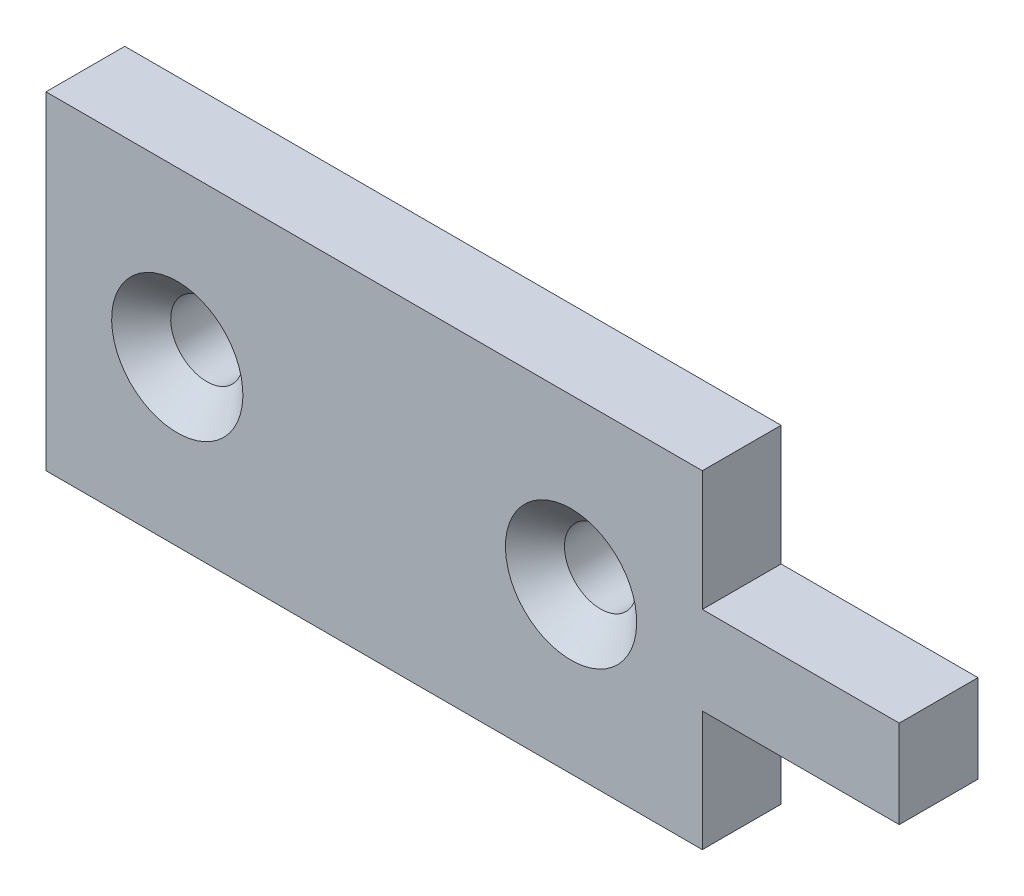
ISO-10303-21;
HEADER;
FILE_DESCRIPTION(('STEP AP214'),'2;1');
FILE_NAME('part.step','',(''),(''),'','','');
FILE_SCHEMA(('AUTOMOTIVE_DESIGN { 1 0 10303 214 1 1 1 1 }'));
ENDSEC;
DATA;
#1=APPLICATION_CONTEXT('core data for automotive mechanical design processes');
#2=APPLICATION_PROTOCOL_DEFINITION('international standard','automotive_design',2000,#1);
#3=PRODUCT_CONTEXT('',#1,'mechanical');
#4=PRODUCT('Part','Part','',(#3));
#5=PRODUCT_RELATED_PRODUCT_CATEGORY('part','',(#4));
#6=PRODUCT_DEFINITION_FORMATION('','',#4);
#7=PRODUCT_DEFINITION_CONTEXT('part definition',#1,'design');
#8=PRODUCT_DEFINITION('design','',#6,#7);
#9=PRODUCT_DEFINITION_SHAPE('','',#8);
#10=(LENGTH_UNIT() NAMED_UNIT(*) SI_UNIT(.MILLI.,.METRE.));
#11=(NAMED_UNIT(*) PLANE_ANGLE_UNIT() SI_UNIT($,.RADIAN.));
#12=(NAMED_UNIT(*) SI_UNIT($,.STERADIAN.) SOLID_ANGLE_UNIT());
#13=UNCERTAINTY_MEASURE_WITH_UNIT(LENGTH_MEASURE(1.E-05),#10,'distance_accuracy_value','');
#14=(GEOMETRIC_REPRESENTATION_CONTEXT(3) GLOBAL_UNCERTAINTY_ASSIGNED_CONTEXT((#13)) GLOBAL_UNIT_ASSIGNED_CONTEXT((#10,
#11,#12)) REPRESENTATION_CONTEXT('',''));
#15=CARTESIAN_POINT('',(0.,0.,0.));
#16=DIRECTION('',(0.,0.,1.));
#17=DIRECTION('',(1.,0.,0.));
#18=AXIS2_PLACEMENT_3D('',#15,#16,#17);
#19=CARTESIAN_POINT('',(55.,3.35,6.));
#20=DIRECTION('',(0.,0.,1.));
#21=DIRECTION('',(0.,1.,0.));
#22=AXIS2_PLACEMENT_3D('',#19,#20,#21);
#23=PLANE('',#22);
#24=CARTESIAN_POINT('',(30.,0.,6.));
#25=DIRECTION('',(0.,0.,1.));
#26=DIRECTION('',(0.,1.,0.));
#27=AXIS2_PLACEMENT_3D('',#24,#25,#26);
#28=CIRCLE('',#27,5.);
#29=CARTESIAN_POINT('',(30.,5.,6.));
#30=VERTEX_POINT('',#29);
#31=EDGE_CURVE('E22',#30,#30,#28,.F.);
#32=ORIENTED_EDGE('',*,*,#31,.T.);
#33=EDGE_LOOP('',(#32));
#34=FACE_BOUND('',#33,.T.);
#35=CARTESIAN_POINT('',(0.,0.,6.));
#36=DIRECTION('',(0.,0.,1.));
#37=DIRECTION('',(0.,1.,0.));
#38=AXIS2_PLACEMENT_3D('',#35,#36,#37);
#39=CIRCLE('',#38,5.);
#40=CARTESIAN_POINT('',(0.,5.,6.));
#41=VERTEX_POINT('',#40);
#42=EDGE_CURVE('E153',#41,#41,#39,.F.);
#43=ORIENTED_EDGE('',*,*,#42,.T.);
#44=EDGE_LOOP('',(#43));
#45=FACE_BOUND('',#44,.T.);
#46=DIRECTION('',(0.,1.,0.));
#47=VECTOR('',#46,1.);
#48=CARTESIAN_POINT('',(55.,-3.35,6.));
#49=LINE('',#48,#47);
#50=CARTESIAN_POINT('',(55.,-3.35,6.));
#51=VERTEX_POINT('',#50);
#52=CARTESIAN_POINT('',(55.,3.35,6.));
#53=VERTEX_POINT('',#52);
#54=EDGE_CURVE('E121',#51,#53,#49,.T.);
#55=ORIENTED_EDGE('',*,*,#54,.T.);
#56=DIRECTION('',(-1.,0.,0.));
#57=VECTOR('',#56,1.);
#58=CARTESIAN_POINT('',(55.,3.35,6.));
#59=LINE('',#58,#57);
#60=CARTESIAN_POINT('',(40.,3.35,6.));
#61=VERTEX_POINT('',#60);
#62=EDGE_CURVE('E95',#53,#61,#59,.T.);
#63=ORIENTED_EDGE('',*,*,#62,.T.);
#64=DIRECTION('',(0.,1.,0.));
#65=VECTOR('',#64,1.);
#66=CARTESIAN_POINT('',(40.,3.35,6.));
#67=LINE('',#66,#65);
#68=CARTESIAN_POINT('',(40.,12.5,6.));
#69=VERTEX_POINT('',#68);
#70=EDGE_CURVE('E124',#61,#69,#67,.T.);
#71=ORIENTED_EDGE('',*,*,#70,.T.);
#72=DIRECTION('',(-1.,0.,0.));
#73=VECTOR('',#72,1.);
#74=CARTESIAN_POINT('',(40.,12.5,6.));
#75=LINE('',#74,#73);
#76=CARTESIAN_POINT('',(-10.,12.5,6.));
#77=VERTEX_POINT('',#76);
#78=EDGE_CURVE('E126',#69,#77,#75,.T.);
#79=ORIENTED_EDGE('',*,*,#78,.T.);
#80=DIRECTION('',(0.,-1.,0.));
#81=VECTOR('',#80,1.);
#82=CARTESIAN_POINT('',(-10.,-12.5,6.));
#83=LINE('',#82,#81);
#84=CARTESIAN_POINT('',(-10.,-12.5,6.));
#85=VERTEX_POINT('',#84);
#86=EDGE_CURVE('E128',#77,#85,#83,.T.);
#87=ORIENTED_EDGE('',*,*,#86,.T.);
#88=DIRECTION('',(1.,0.,0.));
#89=VECTOR('',#88,1.);
#90=CARTESIAN_POINT('',(40.,-12.5,6.));
#91=LINE('',#90,#89);
#92=CARTESIAN_POINT('',(40.,-12.5,6.));
#93=VERTEX_POINT('',#92);
#94=EDGE_CURVE('E130',#85,#93,#91,.T.);
#95=ORIENTED_EDGE('',*,*,#94,.T.);
#96=DIRECTION('',(0.,1.,0.));
#97=VECTOR('',#96,1.);
#98=CARTESIAN_POINT('',(40.,-3.35,6.));
#99=LINE('',#98,#97);
#100=CARTESIAN_POINT('',(40.,-3.35,6.));
#101=VERTEX_POINT('',#100);
#102=EDGE_CURVE('E34',#93,#101,#99,.T.);
#103=ORIENTED_EDGE('',*,*,#102,.T.);
#104=DIRECTION('',(1.,0.,0.));
#105=VECTOR('',#104,1.);
#106=CARTESIAN_POINT('',(55.,-3.35,6.));
#107=LINE('',#106,#105);
#108=EDGE_CURVE('E29',#101,#51,#107,.T.);
#109=ORIENTED_EDGE('',*,*,#108,.T.);
#110=EDGE_LOOP('',(#55,#63,#71,#79,#87,#95,#103,#109));
#111=FACE_BOUND('',#110,.T.);
#112=ADVANCED_FACE('F14',(#34,#45,#111),#23,.T.);
#113=CARTESIAN_POINT('',(55.,3.35,0.));
#114=DIRECTION('',(0.,0.,1.));
#115=DIRECTION('',(0.,1.,0.));
#116=AXIS2_PLACEMENT_3D('',#113,#114,#115);
#117=PLANE('',#116);
#118=CARTESIAN_POINT('',(30.,0.,0.));
#119=DIRECTION('',(0.,0.,1.));
#120=DIRECTION('',(0.,1.,0.));
#121=AXIS2_PLACEMENT_3D('',#118,#119,#120);
#122=CIRCLE('',#121,2.75);
#123=CARTESIAN_POINT('',(30.,2.75,0.));
#124=VERTEX_POINT('',#123);
#125=EDGE_CURVE('E103',#124,#124,#122,.T.);
#126=ORIENTED_EDGE('',*,*,#125,.T.);
#127=EDGE_LOOP('',(#126));
#128=FACE_BOUND('',#127,.T.);
#129=DIRECTION('',(0.,1.,0.));
#130=VECTOR('',#129,1.);
#131=CARTESIAN_POINT('',(55.,-3.35,0.));
#132=LINE('',#131,#130);
#133=CARTESIAN_POINT('',(55.,-3.35,0.));
#134=VERTEX_POINT('',#133);
#135=CARTESIAN_POINT('',(55.,3.35,0.));
#136=VERTEX_POINT('',#135);
#137=EDGE_CURVE('E85',#134,#136,#132,.T.);
#138=ORIENTED_EDGE('',*,*,#137,.F.);
#139=DIRECTION('',(1.,0.,0.));
#140=VECTOR('',#139,1.);
#141=CARTESIAN_POINT('',(55.,-3.35,0.));
#142=LINE('',#141,#140);
#143=CARTESIAN_POINT('',(40.,-3.35,0.));
#144=VERTEX_POINT('',#143);
#145=EDGE_CURVE('E119',#144,#134,#142,.T.);
#146=ORIENTED_EDGE('',*,*,#145,.F.);
#147=DIRECTION('',(0.,1.,0.));
#148=VECTOR('',#147,1.);
#149=CARTESIAN_POINT('',(40.,-3.35,0.));
#150=LINE('',#149,#148);
#151=CARTESIAN_POINT('',(40.,-12.5,0.));
#152=VERTEX_POINT('',#151);
#153=EDGE_CURVE('E117',#152,#144,#150,.T.);
#154=ORIENTED_EDGE('',*,*,#153,.F.);
#155=DIRECTION('',(1.,0.,0.));
#156=VECTOR('',#155,1.);
#157=CARTESIAN_POINT('',(40.,-12.5,0.));
#158=LINE('',#157,#156);
#159=CARTESIAN_POINT('',(-10.,-12.5,0.));
#160=VERTEX_POINT('',#159);
#161=EDGE_CURVE('E115',#160,#152,#158,.T.);
#162=ORIENTED_EDGE('',*,*,#161,.F.);
#163=DIRECTION('',(0.,-1.,0.));
#164=VECTOR('',#163,1.);
#165=CARTESIAN_POINT('',(-10.,-12.5,0.));
#166=LINE('',#165,#164);
#167=CARTESIAN_POINT('',(-10.,12.5,0.));
#168=VERTEX_POINT('',#167);
#169=EDGE_CURVE('E113',#168,#160,#166,.T.);
#170=ORIENTED_EDGE('',*,*,#169,.F.);
#171=DIRECTION('',(-1.,0.,0.));
#172=VECTOR('',#171,1.);
#173=CARTESIAN_POINT('',(40.,12.5,0.));
#174=LINE('',#173,#172);
#175=CARTESIAN_POINT('',(40.,12.5,0.));
#176=VERTEX_POINT('',#175);
#177=EDGE_CURVE('E111',#176,#168,#174,.T.);
#178=ORIENTED_EDGE('',*,*,#177,.F.);
#179=DIRECTION('',(0.,1.,0.));
#180=VECTOR('',#179,1.);
#181=CARTESIAN_POINT('',(40.,3.35,0.));
#182=LINE('',#181,#180);
#183=CARTESIAN_POINT('',(40.,3.35,0.));
#184=VERTEX_POINT('',#183);
#185=EDGE_CURVE('E87',#184,#176,#182,.T.);
#186=ORIENTED_EDGE('',*,*,#185,.F.);
#187=DIRECTION('',(-1.,0.,0.));
#188=VECTOR('',#187,1.);
#189=CARTESIAN_POINT('',(55.,3.35,0.));
#190=LINE('',#189,#188);
#191=EDGE_CURVE('E79',#136,#184,#190,.T.);
#192=ORIENTED_EDGE('',*,*,#191,.F.);
#193=EDGE_LOOP('',(#138,#146,#154,#162,#170,#178,#186,#192));
#194=FACE_BOUND('',#193,.T.);
#195=CARTESIAN_POINT('',(0.,0.,0.));
#196=DIRECTION('',(0.,0.,1.));
#197=DIRECTION('',(0.,1.,0.));
#198=AXIS2_PLACEMENT_3D('',#195,#196,#197);
#199=CIRCLE('',#198,2.75);
#200=CARTESIAN_POINT('',(0.,2.75,0.));
#201=VERTEX_POINT('',#200);
#202=EDGE_CURVE('E106',#201,#201,#199,.T.);
#203=ORIENTED_EDGE('',*,*,#202,.T.);
#204=EDGE_LOOP('',(#203));
#205=FACE_BOUND('',#204,.T.);
#206=ADVANCED_FACE('F81',(#128,#194,#205),#117,.F.);
#207=CARTESIAN_POINT('',(55.,-3.35,6.));
#208=DIRECTION('',(-1.,0.,0.));
#209=DIRECTION('',(0.,-1.,0.));
#210=AXIS2_PLACEMENT_3D('',#207,#208,#209);
#211=PLANE('',#210);
#212=ORIENTED_EDGE('',*,*,#137,.T.);
#213=DIRECTION('',(0.,0.,-1.));
#214=VECTOR('',#213,1.);
#215=CARTESIAN_POINT('',(55.,3.35,6.));
#216=LINE('',#215,#214);
#217=EDGE_CURVE('E93',#53,#136,#216,.T.);
#218=ORIENTED_EDGE('',*,*,#217,.F.);
#219=ORIENTED_EDGE('',*,*,#54,.F.);
#220=DIRECTION('',(0.,0.,-1.));
#221=VECTOR('',#220,1.);
#222=CARTESIAN_POINT('',(55.,-3.35,6.));
#223=LINE('',#222,#221);
#224=EDGE_CURVE('E102',#51,#134,#223,.T.);
#225=ORIENTED_EDGE('',*,*,#224,.T.);
#226=EDGE_LOOP('',(#212,#218,#219,#225));
#227=FACE_BOUND('',#226,.T.);
#228=ADVANCED_FACE('F16',(#227),#211,.F.);
#229=CARTESIAN_POINT('',(55.,3.35,6.));
#230=DIRECTION('',(0.,-1.,0.));
#231=DIRECTION('',(1.,0.,0.));
#232=AXIS2_PLACEMENT_3D('',#229,#230,#231);
#233=PLANE('',#232);
#234=ORIENTED_EDGE('',*,*,#191,.T.);
#235=DIRECTION('',(0.,0.,-1.));
#236=VECTOR('',#235,1.);
#237=CARTESIAN_POINT('',(40.,3.35,6.));
#238=LINE('',#237,#236);
#239=EDGE_CURVE('E99',#61,#184,#238,.T.);
#240=ORIENTED_EDGE('',*,*,#239,.F.);
#241=ORIENTED_EDGE('',*,*,#62,.F.);
#242=ORIENTED_EDGE('',*,*,#217,.T.);
#243=EDGE_LOOP('',(#234,#240,#241,#242));
#244=FACE_BOUND('',#243,.T.);
#245=ADVANCED_FACE('F94',(#244),#233,.F.);
#246=CARTESIAN_POINT('',(40.,3.35,6.));
#247=DIRECTION('',(-1.,0.,0.));
#248=DIRECTION('',(0.,-1.,0.));
#249=AXIS2_PLACEMENT_3D('',#246,#247,#248);
#250=PLANE('',#249);
#251=ORIENTED_EDGE('',*,*,#185,.T.);
#252=DIRECTION('',(0.,0.,-1.));
#253=VECTOR('',#252,1.);
#254=CARTESIAN_POINT('',(40.,12.5,6.));
#255=LINE('',#254,#253);
#256=EDGE_CURVE('E147',#69,#176,#255,.T.);
#257=ORIENTED_EDGE('',*,*,#256,.F.);
#258=ORIENTED_EDGE('',*,*,#70,.F.);
#259=ORIENTED_EDGE('',*,*,#239,.T.);
#260=EDGE_LOOP('',(#251,#257,#258,#259));
#261=FACE_BOUND('',#260,.T.);
#262=ADVANCED_FACE('F203',(#261),#250,.F.);
#263=CARTESIAN_POINT('',(40.,12.5,6.));
#264=DIRECTION('',(0.,-1.,0.));
#265=DIRECTION('',(1.,0.,0.));
#266=AXIS2_PLACEMENT_3D('',#263,#264,#265);
#267=PLANE('',#266);
#268=ORIENTED_EDGE('',*,*,#177,.T.);
#269=DIRECTION('',(0.,0.,-1.));
#270=VECTOR('',#269,1.);
#271=CARTESIAN_POINT('',(-10.,12.5,6.));
#272=LINE('',#271,#270);
#273=EDGE_CURVE('E144',#77,#168,#272,.T.);
#274=ORIENTED_EDGE('',*,*,#273,.F.);
#275=ORIENTED_EDGE('',*,*,#78,.F.);
#276=ORIENTED_EDGE('',*,*,#256,.T.);
#277=EDGE_LOOP('',(#268,#274,#275,#276));
#278=FACE_BOUND('',#277,.T.);
#279=ADVANCED_FACE('F199',(#278),#267,.F.);
#280=CARTESIAN_POINT('',(-10.,-12.5,6.));
#281=DIRECTION('',(1.,0.,0.));
#282=DIRECTION('',(0.,1.,0.));
#283=AXIS2_PLACEMENT_3D('',#280,#281,#282);
#284=PLANE('',#283);
#285=ORIENTED_EDGE('',*,*,#169,.T.);
#286=DIRECTION('',(0.,0.,-1.));
#287=VECTOR('',#286,1.);
#288=CARTESIAN_POINT('',(-10.,-12.5,6.));
#289=LINE('',#288,#287);
#290=EDGE_CURVE('E141',#85,#160,#289,.T.);
#291=ORIENTED_EDGE('',*,*,#290,.F.);
#292=ORIENTED_EDGE('',*,*,#86,.F.);
#293=ORIENTED_EDGE('',*,*,#273,.T.);
#294=EDGE_LOOP('',(#285,#291,#292,#293));
#295=FACE_BOUND('',#294,.T.);
#296=ADVANCED_FACE('F195',(#295),#284,.F.);
#297=CARTESIAN_POINT('',(40.,-12.5,6.));
#298=DIRECTION('',(0.,1.,0.));
#299=DIRECTION('',(-1.,0.,0.));
#300=AXIS2_PLACEMENT_3D('',#297,#298,#299);
#301=PLANE('',#300);
#302=ORIENTED_EDGE('',*,*,#161,.T.);
#303=DIRECTION('',(0.,0.,-1.));
#304=VECTOR('',#303,1.);
#305=CARTESIAN_POINT('',(40.,-12.5,6.));
#306=LINE('',#305,#304);
#307=EDGE_CURVE('E138',#93,#152,#306,.T.);
#308=ORIENTED_EDGE('',*,*,#307,.F.);
#309=ORIENTED_EDGE('',*,*,#94,.F.);
#310=ORIENTED_EDGE('',*,*,#290,.T.);
#311=EDGE_LOOP('',(#302,#308,#309,#310));
#312=FACE_BOUND('',#311,.T.);
#313=ADVANCED_FACE('F191',(#312),#301,.F.);
#314=CARTESIAN_POINT('',(40.,-3.35,6.));
#315=DIRECTION('',(-1.,0.,0.));
#316=DIRECTION('',(0.,-1.,0.));
#317=AXIS2_PLACEMENT_3D('',#314,#315,#316);
#318=PLANE('',#317);
#319=ORIENTED_EDGE('',*,*,#153,.T.);
#320=DIRECTION('',(0.,0.,-1.));
#321=VECTOR('',#320,1.);
#322=CARTESIAN_POINT('',(40.,-3.35,6.));
#323=LINE('',#322,#321);
#324=EDGE_CURVE('E135',#101,#144,#323,.T.);
#325=ORIENTED_EDGE('',*,*,#324,.F.);
#326=ORIENTED_EDGE('',*,*,#102,.F.);
#327=ORIENTED_EDGE('',*,*,#307,.T.);
#328=EDGE_LOOP('',(#319,#325,#326,#327));
#329=FACE_BOUND('',#328,.T.);
#330=ADVANCED_FACE('F187',(#329),#318,.F.);
#331=CARTESIAN_POINT('',(55.,-3.35,6.));
#332=DIRECTION('',(0.,1.,0.));
#333=DIRECTION('',(-1.,0.,0.));
#334=AXIS2_PLACEMENT_3D('',#331,#332,#333);
#335=PLANE('',#334);
#336=ORIENTED_EDGE('',*,*,#145,.T.);
#337=ORIENTED_EDGE('',*,*,#224,.F.);
#338=ORIENTED_EDGE('',*,*,#108,.F.);
#339=ORIENTED_EDGE('',*,*,#324,.T.);
#340=EDGE_LOOP('',(#336,#337,#338,#339));
#341=FACE_BOUND('',#340,.T.);
#342=ADVANCED_FACE('F171',(#341),#335,.F.);
#343=CARTESIAN_POINT('',(30.,0.,6.));
#344=DIRECTION('',(0.,0.,-1.));
#345=DIRECTION('',(0.,-1.,0.));
#346=AXIS2_PLACEMENT_3D('',#343,#344,#345);
#347=CYLINDRICAL_SURFACE('',#346,2.75);
#348=CARTESIAN_POINT('',(30.,0.,3.75));
#349=DIRECTION('',(0.,0.,1.));
#350=DIRECTION('',(0.,1.,0.));
#351=AXIS2_PLACEMENT_3D('',#348,#349,#350);
#352=CIRCLE('',#351,2.75);
#353=CARTESIAN_POINT('',(30.,2.75,3.75));
#354=VERTEX_POINT('',#353);
#355=EDGE_CURVE('E98',#354,#354,#352,.T.);
#356=ORIENTED_EDGE('',*,*,#355,.T.);
#357=EDGE_LOOP('',(#356));
#358=FACE_BOUND('',#357,.T.);
#359=ORIENTED_EDGE('',*,*,#125,.F.);
#360=EDGE_LOOP('',(#359));
#361=FACE_BOUND('',#360,.T.);
#362=ADVANCED_FACE('F168',(#358,#361),#347,.F.);
#363=CARTESIAN_POINT('',(0.,0.,6.));
#364=DIRECTION('',(0.,0.,-1.));
#365=DIRECTION('',(0.,-1.,0.));
#366=AXIS2_PLACEMENT_3D('',#363,#364,#365);
#367=CYLINDRICAL_SURFACE('',#366,2.75);
#368=CARTESIAN_POINT('',(0.,0.,3.75));
#369=DIRECTION('',(0.,0.,1.));
#370=DIRECTION('',(0.,1.,0.));
#371=AXIS2_PLACEMENT_3D('',#368,#369,#370);
#372=CIRCLE('',#371,2.75);
#373=CARTESIAN_POINT('',(0.,2.75,3.75));
#374=VERTEX_POINT('',#373);
#375=EDGE_CURVE('E9',#374,#374,#372,.T.);
#376=ORIENTED_EDGE('',*,*,#375,.T.);
#377=EDGE_LOOP('',(#376));
#378=FACE_BOUND('',#377,.T.);
#379=ORIENTED_EDGE('',*,*,#202,.F.);
#380=EDGE_LOOP('',(#379));
#381=FACE_BOUND('',#380,.T.);
#382=ADVANCED_FACE('F164',(#378,#381),#367,.F.);
#383=CARTESIAN_POINT('',(30.,0.,3.75));
#384=DIRECTION('',(0.,0.,1.));
#385=DIRECTION('',(0.,1.,0.));
#386=AXIS2_PLACEMENT_3D('',#383,#384,#385);
#387=CONICAL_SURFACE('',#386,2.75,0.785398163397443);
#388=ORIENTED_EDGE('',*,*,#31,.F.);
#389=EDGE_LOOP('',(#388));
#390=FACE_BOUND('',#389,.T.);
#391=ORIENTED_EDGE('',*,*,#355,.F.);
#392=EDGE_LOOP('',(#391));
#393=FACE_BOUND('',#392,.T.);
#394=ADVANCED_FACE('F160',(#390,#393),#387,.F.);
#395=CARTESIAN_POINT('',(0.,0.,3.75));
#396=DIRECTION('',(0.,0.,1.));
#397=DIRECTION('',(0.,1.,0.));
#398=AXIS2_PLACEMENT_3D('',#395,#396,#397);
#399=CONICAL_SURFACE('',#398,2.75,0.785398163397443);
#400=ORIENTED_EDGE('',*,*,#42,.F.);
#401=EDGE_LOOP('',(#400));
#402=FACE_BOUND('',#401,.T.);
#403=ORIENTED_EDGE('',*,*,#375,.F.);
#404=EDGE_LOOP('',(#403));
#405=FACE_BOUND('',#404,.T.);
#406=ADVANCED_FACE('F163',(#402,#405),#399,.F.);
#407=CLOSED_SHELL('',(#112,#206,#228,#245,#262,#279,#296,#313,#330,#342,#362,#382,#394,#406));
#408=MANIFOLD_SOLID_BREP('B1',#407);
#409=ADVANCED_BREP_SHAPE_REPRESENTATION('',(#18,#408),#14);
#410=SHAPE_DEFINITION_REPRESENTATION(#9,#409);
ENDSEC;
END-ISO-10303-21;
